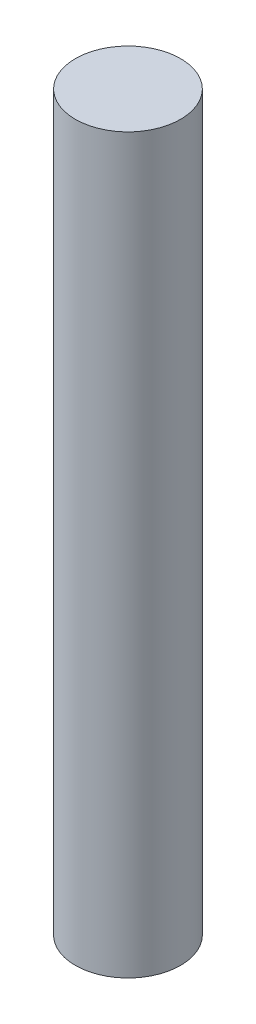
from build123d import *

# Parameters (mm, degrees)
SKETCH2_R           = 9.525
BOSS_EXTRUDE1_DEPTH = 132.6642


with BuildPart() as part:
    # Sketch2 → Boss-Extrude1 (new body)
    with BuildSketch(Plane(origin=(0, 0, 0), x_dir=(1, 0, 0), z_dir=(0, 1, 0))):
        with Locations(Location((0, 0, 0), (0, 0, 270))):
            Circle(SKETCH2_R)
    extrude(amount=BOSS_EXTRUDE1_DEPTH)


solid = part.part
